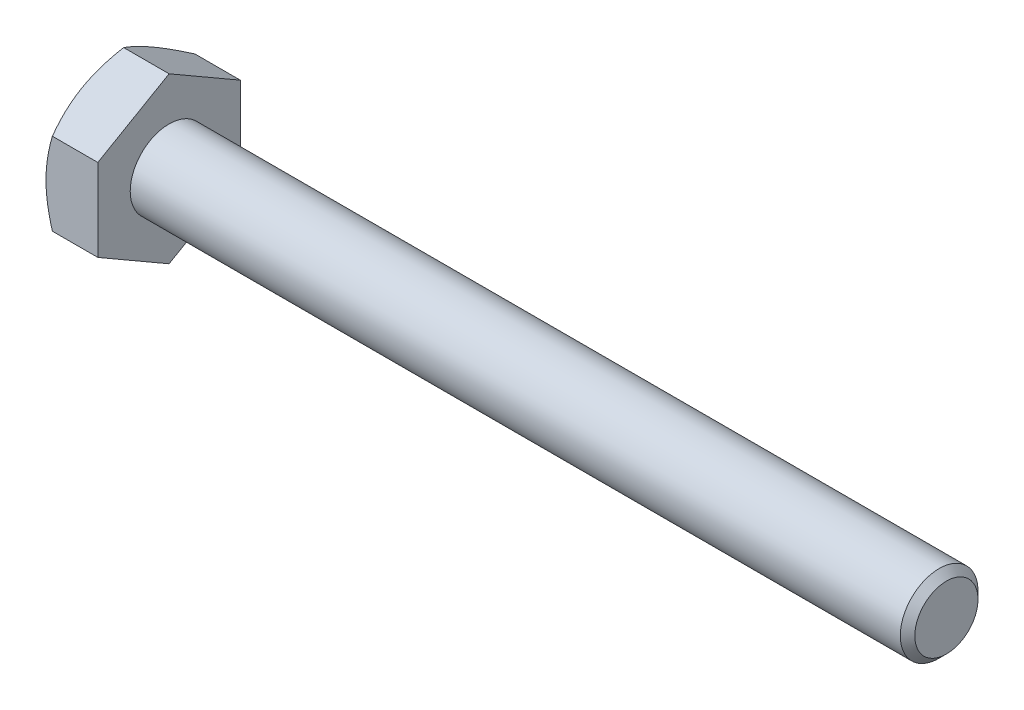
ISO-10303-21;
HEADER;
FILE_DESCRIPTION(('STEP AP214'),'2;1');
FILE_NAME('part.step','',(''),(''),'','','');
FILE_SCHEMA(('AUTOMOTIVE_DESIGN { 1 0 10303 214 1 1 1 1 }'));
ENDSEC;
DATA;
#1=APPLICATION_CONTEXT('core data for automotive mechanical design processes');
#2=APPLICATION_PROTOCOL_DEFINITION('international standard','automotive_design',2000,#1);
#3=PRODUCT_CONTEXT('',#1,'mechanical');
#4=PRODUCT('Part','Part','',(#3));
#5=PRODUCT_RELATED_PRODUCT_CATEGORY('part','',(#4));
#6=PRODUCT_DEFINITION_FORMATION('','',#4);
#7=PRODUCT_DEFINITION_CONTEXT('part definition',#1,'design');
#8=PRODUCT_DEFINITION('design','',#6,#7);
#9=PRODUCT_DEFINITION_SHAPE('','',#8);
#10=(LENGTH_UNIT() NAMED_UNIT(*) SI_UNIT(.MILLI.,.METRE.));
#11=(NAMED_UNIT(*) PLANE_ANGLE_UNIT() SI_UNIT($,.RADIAN.));
#12=(NAMED_UNIT(*) SI_UNIT($,.STERADIAN.) SOLID_ANGLE_UNIT());
#13=UNCERTAINTY_MEASURE_WITH_UNIT(LENGTH_MEASURE(1.E-05),#10,'distance_accuracy_value','');
#14=(GEOMETRIC_REPRESENTATION_CONTEXT(3) GLOBAL_UNCERTAINTY_ASSIGNED_CONTEXT((#13)) GLOBAL_UNIT_ASSIGNED_CONTEXT((#10,
#11,#12)) REPRESENTATION_CONTEXT('',''));
#15=CARTESIAN_POINT('',(0.,0.,0.));
#16=DIRECTION('',(0.,0.,1.));
#17=DIRECTION('',(1.,0.,0.));
#18=AXIS2_PLACEMENT_3D('',#15,#16,#17);
#19=CARTESIAN_POINT('',(2.,1.58771324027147,-2.75));
#20=DIRECTION('',(0.,-0.866025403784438,0.500000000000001));
#21=DIRECTION('',(0.,-0.500000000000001,-0.866025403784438));
#22=AXIS2_PLACEMENT_3D('',#19,#20,#21);
#23=PLANE('',#22);
#24=CARTESIAN_POINT('',(0.245686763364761,3.17554195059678,0.0002));
#25=CARTESIAN_POINT('',(0.205387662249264,3.10576962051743,-0.120649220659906));
#26=CARTESIAN_POINT('',(0.168736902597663,3.03539502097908,-0.242541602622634));
#27=CARTESIAN_POINT('',(0.104762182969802,2.89342717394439,-0.488437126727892));
#28=CARTESIAN_POINT('',(0.0774608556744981,2.82183140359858,-0.612444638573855));
#29=CARTESIAN_POINT('',(0.0349617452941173,2.67952717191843,-0.858922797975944));
#30=CARTESIAN_POINT('',(0.0194811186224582,2.60884060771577,-0.981355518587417));
#31=CARTESIAN_POINT('',(0.000999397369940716,2.46713482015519,-1.22679714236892));
#32=CARTESIAN_POINT('',(-0.00201700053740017,2.39611611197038,-1.34980515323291));
#33=CARTESIAN_POINT('',(0.00425314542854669,2.26341005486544,-1.57965878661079));
#34=CARTESIAN_POINT('',(0.0120001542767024,2.20170285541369,-1.68653879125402));
#35=CARTESIAN_POINT('',(0.0365551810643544,2.07869048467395,-1.89960246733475));
#36=CARTESIAN_POINT('',(0.0533715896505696,2.01738573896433,-2.00578540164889));
#37=CARTESIAN_POINT('',(0.0954119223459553,1.89411967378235,-2.21928848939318));
#38=CARTESIAN_POINT('',(0.12081408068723,1.83217395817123,-2.32658161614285));
#39=CARTESIAN_POINT('',(0.178467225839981,1.70920651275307,-2.53956747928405));
#40=CARTESIAN_POINT('',(0.210704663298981,1.64818320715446,-2.64526294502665));
#41=CARTESIAN_POINT('',(0.245686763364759,1.58759777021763,-2.7502));
#42=B_SPLINE_CURVE_WITH_KNOTS('',3,(#24,#25,#26,#27,#28,#29,#30,#31,#32,#33,#34,#35,#36,#37,#38,
#39,#40,#41),.UNSPECIFIED.,.F.,.F.,(4,2,2,2,2,2,2,2,4),(0.,0.435912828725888,0.872873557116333,
1.29901931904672,1.72464171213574,2.09526089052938,2.46622354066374,2.84541551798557,
3.22386274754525),.UNSPECIFIED.);
#43=CARTESIAN_POINT('',(0.245620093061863,3.17542648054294,0.));
#44=VERTEX_POINT('',#43);
#45=CARTESIAN_POINT('',(0.,2.3815698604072,-1.375));
#46=VERTEX_POINT('',#45);
#47=EDGE_CURVE('E55',#44,#46,#42,.T.);
#48=ORIENTED_EDGE('',*,*,#47,.F.);
#49=DIRECTION('',(-1.,0.,0.));
#50=VECTOR('',#49,1.);
#51=CARTESIAN_POINT('',(2.,3.17542648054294,0.));
#52=LINE('',#51,#50);
#53=CARTESIAN_POINT('',(2.,3.17542648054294,0.));
#54=VERTEX_POINT('',#53);
#55=EDGE_CURVE('E151',#54,#44,#52,.T.);
#56=ORIENTED_EDGE('',*,*,#55,.F.);
#57=DIRECTION('',(0.,0.500000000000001,0.866025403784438));
#58=VECTOR('',#57,1.);
#59=CARTESIAN_POINT('',(2.,1.58771324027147,-2.75));
#60=LINE('',#59,#58);
#61=CARTESIAN_POINT('',(2.,1.58771324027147,-2.75));
#62=VERTEX_POINT('',#61);
#63=EDGE_CURVE('E242',#62,#54,#60,.T.);
#64=ORIENTED_EDGE('',*,*,#63,.F.);
#65=DIRECTION('',(-1.,0.,0.));
#66=VECTOR('',#65,1.);
#67=CARTESIAN_POINT('',(2.,1.58771324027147,-2.75));
#68=LINE('',#67,#66);
#69=CARTESIAN_POINT('',(0.245620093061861,1.58771324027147,-2.75));
#70=VERTEX_POINT('',#69);
#71=EDGE_CURVE('E139',#62,#70,#68,.T.);
#72=ORIENTED_EDGE('',*,*,#71,.T.);
#73=EDGE_CURVE('E133',#46,#70,#42,.T.);
#74=ORIENTED_EDGE('',*,*,#73,.F.);
#75=EDGE_LOOP('',(#48,#56,#64,#72,#74));
#76=FACE_BOUND('',#75,.T.);
#77=ADVANCED_FACE('F39',(#76),#23,.F.);
#78=CARTESIAN_POINT('',(2.,3.17542648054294,0.));
#79=DIRECTION('',(0.,-0.866025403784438,-0.500000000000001));
#80=DIRECTION('',(0.,0.500000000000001,-0.866025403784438));
#81=AXIS2_PLACEMENT_3D('',#78,#79,#80);
#82=PLANE('',#81);
#83=CARTESIAN_POINT('',(0.24568676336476,1.58759777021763,2.7502));
#84=CARTESIAN_POINT('',(0.205387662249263,1.65737010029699,2.62935077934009));
#85=CARTESIAN_POINT('',(0.168736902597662,1.72774469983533,2.50745839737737));
#86=CARTESIAN_POINT('',(0.104762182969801,1.86971254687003,2.26156287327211));
#87=CARTESIAN_POINT('',(0.0774608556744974,1.94130831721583,2.13755536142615));
#88=CARTESIAN_POINT('',(0.0349617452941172,2.08361254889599,1.89107720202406));
#89=CARTESIAN_POINT('',(0.0194811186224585,2.15429911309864,1.76864448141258));
#90=CARTESIAN_POINT('',(0.000999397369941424,2.29600490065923,1.52320285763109));
#91=CARTESIAN_POINT('',(-0.00201700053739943,2.36702360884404,1.40019484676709));
#92=CARTESIAN_POINT('',(0.00425314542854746,2.49972966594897,1.17034121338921));
#93=CARTESIAN_POINT('',(0.0120001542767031,2.56143686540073,1.06346120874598));
#94=CARTESIAN_POINT('',(0.0365551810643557,2.68444923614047,0.850397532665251));
#95=CARTESIAN_POINT('',(0.0533715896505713,2.74575398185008,0.744214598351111));
#96=CARTESIAN_POINT('',(0.0954119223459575,2.86902004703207,0.530711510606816));
#97=CARTESIAN_POINT('',(0.120814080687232,2.93096576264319,0.423418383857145));
#98=CARTESIAN_POINT('',(0.178467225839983,3.05393320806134,0.210432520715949));
#99=CARTESIAN_POINT('',(0.210704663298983,3.11495651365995,0.104737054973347));
#100=CARTESIAN_POINT('',(0.245686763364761,3.17554195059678,-0.000200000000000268));
#101=B_SPLINE_CURVE_WITH_KNOTS('',3,(#83,#84,#85,#86,#87,#88,#89,#90,#91,#92,#93,#94,#95,#96,
#97,#98,#99,#100),.UNSPECIFIED.,.F.,.F.,(4,2,2,2,2,2,2,2,4),(0.,0.435912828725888,
0.872873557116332,1.29901931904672,1.72464171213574,2.09526089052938,2.46622354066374,
2.84541551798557,3.22386274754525),.UNSPECIFIED.);
#102=CARTESIAN_POINT('',(0.245620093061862,1.58771324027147,2.75));
#103=VERTEX_POINT('',#102);
#104=CARTESIAN_POINT('',(0.,2.3815698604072,1.375));
#105=VERTEX_POINT('',#104);
#106=EDGE_CURVE('E62',#103,#105,#101,.T.);
#107=ORIENTED_EDGE('',*,*,#106,.F.);
#108=DIRECTION('',(-1.,0.,0.));
#109=VECTOR('',#108,1.);
#110=CARTESIAN_POINT('',(2.,1.58771324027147,2.75));
#111=LINE('',#110,#109);
#112=CARTESIAN_POINT('',(2.,1.58771324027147,2.75));
#113=VERTEX_POINT('',#112);
#114=EDGE_CURVE('E149',#113,#103,#111,.T.);
#115=ORIENTED_EDGE('',*,*,#114,.F.);
#116=DIRECTION('',(0.,-0.500000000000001,0.866025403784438));
#117=VECTOR('',#116,1.);
#118=CARTESIAN_POINT('',(2.,3.17542648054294,0.));
#119=LINE('',#118,#117);
#120=EDGE_CURVE('E240',#54,#113,#119,.T.);
#121=ORIENTED_EDGE('',*,*,#120,.F.);
#122=ORIENTED_EDGE('',*,*,#55,.T.);
#123=EDGE_CURVE('E166',#105,#44,#101,.T.);
#124=ORIENTED_EDGE('',*,*,#123,.F.);
#125=EDGE_LOOP('',(#107,#115,#121,#122,#124));
#126=FACE_BOUND('',#125,.T.);
#127=ADVANCED_FACE('F172',(#126),#82,.F.);
#128=CARTESIAN_POINT('',(2.,1.58771324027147,2.75));
#129=DIRECTION('',(0.,0.,-1.));
#130=DIRECTION('',(0.,1.,0.));
#131=AXIS2_PLACEMENT_3D('',#128,#129,#130);
#132=PLANE('',#131);
#133=CARTESIAN_POINT('',(1.36715210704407,-4.31638594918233,2.75));
#134=CARTESIAN_POINT('',(1.30845994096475,-4.19581737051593,2.75));
#135=CARTESIAN_POINT('',(1.25031586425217,-4.07497746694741,2.75));
#136=CARTESIAN_POINT('',(1.1354311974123,-3.83261088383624,2.75));
#137=CARTESIAN_POINT('',(1.07869081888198,-3.71108410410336,2.75));
#138=CARTESIAN_POINT('',(0.966646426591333,-3.46659808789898,2.75));
#139=CARTESIAN_POINT('',(0.911351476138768,-3.34363468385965,2.75));
#140=CARTESIAN_POINT('',(0.802956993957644,-3.09674757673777,2.75));
#141=CARTESIAN_POINT('',(0.749857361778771,-2.97282391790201,2.75));
#142=CARTESIAN_POINT('',(0.644703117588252,-2.71965806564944,2.75));
#143=CARTESIAN_POINT('',(0.592742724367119,-2.59037652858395,2.75));
#144=CARTESIAN_POINT('',(0.492631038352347,-2.33032018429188,2.75));
#145=CARTESIAN_POINT('',(0.444480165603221,-2.19954521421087,2.75));
#146=CARTESIAN_POINT('',(0.353213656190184,-1.9365223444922,2.75));
#147=CARTESIAN_POINT('',(0.310088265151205,-1.80427786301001,2.75));
#148=CARTESIAN_POINT('',(0.230222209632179,-1.53789259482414,2.75));
#149=CARTESIAN_POINT('',(0.193479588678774,-1.40375240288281,2.75));
#150=CARTESIAN_POINT('',(0.12830206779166,-1.13423793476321,2.75));
#151=CARTESIAN_POINT('',(0.0998212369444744,-0.998874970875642,2.75));
#152=CARTESIAN_POINT('',(0.0527456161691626,-0.726413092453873,2.75));
#153=CARTESIAN_POINT('',(0.0341497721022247,-0.589314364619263,2.75));
#154=CARTESIAN_POINT('',(0.0085685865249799,-0.315877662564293,2.75));
#155=CARTESIAN_POINT('',(0.00142992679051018,-0.17955439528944,2.75));
#156=CARTESIAN_POINT('',(-0.00103867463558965,0.093213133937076,2.75));
#157=CARTESIAN_POINT('',(0.00363158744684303,0.229657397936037,2.75));
#158=CARTESIAN_POINT('',(0.021130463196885,0.459764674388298,2.75));
#159=CARTESIAN_POINT('',(0.0310050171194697,0.553667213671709,2.75));
#160=CARTESIAN_POINT('',(0.0557601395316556,0.740814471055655,2.75));
#161=CARTESIAN_POINT('',(0.0706413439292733,0.834059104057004,2.75));
#162=CARTESIAN_POINT('',(0.122015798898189,1.1126628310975,2.75));
#163=CARTESIAN_POINT('',(0.165231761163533,1.29679769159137,2.75));
#164=CARTESIAN_POINT('',(0.240559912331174,1.57226006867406,2.75));
#165=CARTESIAN_POINT('',(0.267790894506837,1.66500394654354,2.75));
#166=CARTESIAN_POINT('',(0.325176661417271,1.84959145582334,2.75));
#167=CARTESIAN_POINT('',(0.355331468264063,1.94143508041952,2.75));
#168=CARTESIAN_POINT('',(0.418073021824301,2.12425036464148,2.75));
#169=CARTESIAN_POINT('',(0.450659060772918,2.21522226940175,2.75));
#170=CARTESIAN_POINT('',(0.517870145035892,2.39640501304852,2.75));
#171=CARTESIAN_POINT('',(0.552495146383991,2.48661586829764,2.75));
#172=CARTESIAN_POINT('',(0.647111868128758,2.72631941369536,2.75));
#173=CARTESIAN_POINT('',(0.708617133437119,2.87521406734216,2.75));
#174=CARTESIAN_POINT('',(0.83516310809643,3.17149877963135,2.75));
#175=CARTESIAN_POINT('',(0.900204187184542,3.31888867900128,2.75));
#176=CARTESIAN_POINT('',(1.03299372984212,3.61249860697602,2.75));
#177=CARTESIAN_POINT('',(1.1007430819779,3.75871823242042,2.75));
#178=CARTESIAN_POINT('',(1.23832197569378,4.05017738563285,2.75));
#179=CARTESIAN_POINT('',(1.30815157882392,4.19541688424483,2.75));
#180=CARTESIAN_POINT('',(1.5202722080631,4.63039070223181,2.75));
#181=CARTESIAN_POINT('',(1.66499194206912,4.91893915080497,2.75));
#182=CARTESIAN_POINT('',(1.95851426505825,5.49386340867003,2.75));
#183=CARTESIAN_POINT('',(2.10731603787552,5.78023963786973,2.75));
#184=CARTESIAN_POINT('',(2.39216757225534,6.32194576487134,2.75));
#185=CARTESIAN_POINT('',(2.52794261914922,6.57742037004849,2.75));
#186=CARTESIAN_POINT('',(2.80114245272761,7.08750371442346,2.75));
#187=CARTESIAN_POINT('',(2.93856733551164,7.34211240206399,2.75));
#188=CARTESIAN_POINT('',(3.21419429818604,7.84983547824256,2.75));
#189=CARTESIAN_POINT('',(3.35239239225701,8.10295203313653,2.75));
#190=CARTESIAN_POINT('',(3.62973059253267,8.60864374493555,2.75));
#191=CARTESIAN_POINT('',(3.76887062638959,8.86121894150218,2.75));
#192=CARTESIAN_POINT('',(3.90835389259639,9.11360311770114,2.75));
#193=B_SPLINE_CURVE_WITH_KNOTS('',3,(#133,#134,#135,#136,#137,#138,#139,#140,#141,#142,#143,
#144,#145,#146,#147,#148,#149,#150,#151,#152,#153,#154,#155,#156,#157,#158,#159,#160,#161,#162,
#163,#164,#165,#166,#167,#168,#169,#170,#171,#172,#173,#174,#175,#176,#177,#178,#179,#180,#181,
#182,#183,#184,#185,#186,#187,#188,#189,#190,#191,#192),.UNSPECIFIED.,.F.,.F.,(4,2,2,2,2,2,2,2,
2,2,2,2,2,2,2,2,2,2,2,2,2,2,2,2,2,2,2,2,2,4),(0.,0.40229060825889,0.804641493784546,
1.20909649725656,1.61353297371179,2.03148461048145,2.44948226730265,2.86665458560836,
3.28369880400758,3.69837799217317,4.11301294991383,4.52205162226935,4.9310973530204,
5.21422195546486,5.49738253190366,6.06398562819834,6.35393648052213,6.6438895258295,
6.933758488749,7.2236212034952,7.70684704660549,8.19012351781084,8.67355987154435,
9.15701054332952,10.1253686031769,11.0935344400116,11.9614658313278,12.8294480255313,
13.6946049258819,14.5596961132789),.UNSPECIFIED.);
#194=CARTESIAN_POINT('',(0.245620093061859,-1.58771324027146,2.75));
#195=VERTEX_POINT('',#194);
#196=CARTESIAN_POINT('',(0.,0.,2.75));
#197=VERTEX_POINT('',#196);
#198=EDGE_CURVE('E252',#195,#197,#193,.T.);
#199=ORIENTED_EDGE('',*,*,#198,.F.);
#200=DIRECTION('',(-1.,0.,0.));
#201=VECTOR('',#200,1.);
#202=CARTESIAN_POINT('',(2.,-1.58771324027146,2.75));
#203=LINE('',#202,#201);
#204=CARTESIAN_POINT('',(2.,-1.58771324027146,2.75));
#205=VERTEX_POINT('',#204);
#206=EDGE_CURVE('E141',#205,#195,#203,.T.);
#207=ORIENTED_EDGE('',*,*,#206,.F.);
#208=DIRECTION('',(0.,-1.,0.));
#209=VECTOR('',#208,1.);
#210=CARTESIAN_POINT('',(2.,1.58771324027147,2.75));
#211=LINE('',#210,#209);
#212=EDGE_CURVE('E236',#113,#205,#211,.T.);
#213=ORIENTED_EDGE('',*,*,#212,.F.);
#214=ORIENTED_EDGE('',*,*,#114,.T.);
#215=EDGE_CURVE('E190',#197,#103,#193,.T.);
#216=ORIENTED_EDGE('',*,*,#215,.F.);
#217=EDGE_LOOP('',(#199,#207,#213,#214,#216));
#218=FACE_BOUND('',#217,.T.);
#219=ADVANCED_FACE('F258',(#218),#132,.F.);
#220=CARTESIAN_POINT('',(2.,-3.17542648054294,0.));
#221=DIRECTION('',(0.,0.866025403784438,-0.500000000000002));
#222=DIRECTION('',(0.,0.500000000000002,0.866025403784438));
#223=AXIS2_PLACEMENT_3D('',#220,#221,#222);
#224=PLANE('',#223);
#225=CARTESIAN_POINT('',(0.245686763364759,-3.17554195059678,-0.000200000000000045));
#226=CARTESIAN_POINT('',(0.205387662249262,-3.10576962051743,0.120649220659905));
#227=CARTESIAN_POINT('',(0.168736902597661,-3.03539502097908,0.242541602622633));
#228=CARTESIAN_POINT('',(0.104762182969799,-2.89342717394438,0.488437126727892));
#229=CARTESIAN_POINT('',(0.0774608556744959,-2.82183140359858,0.612444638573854));
#230=CARTESIAN_POINT('',(0.0349617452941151,-2.67952717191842,0.858922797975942));
#231=CARTESIAN_POINT('',(0.019481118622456,-2.60884060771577,0.981355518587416));
#232=CARTESIAN_POINT('',(0.000999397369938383,-2.46713482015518,1.22679714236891));
#233=CARTESIAN_POINT('',(-0.00201700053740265,-2.39611611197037,1.34980515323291));
#234=CARTESIAN_POINT('',(0.00425314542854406,-2.26341005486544,1.57965878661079));
#235=CARTESIAN_POINT('',(0.0120001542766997,-2.20170285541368,1.68653879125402));
#236=CARTESIAN_POINT('',(0.0365551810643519,-2.07869048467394,1.89960246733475));
#237=CARTESIAN_POINT('',(0.0533715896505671,-2.01738573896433,2.00578540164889));
#238=CARTESIAN_POINT('',(0.095411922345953,-1.89411967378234,2.21928848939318));
#239=CARTESIAN_POINT('',(0.120814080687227,-1.83217395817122,2.32658161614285));
#240=CARTESIAN_POINT('',(0.178467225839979,-1.70920651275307,2.53956747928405));
#241=CARTESIAN_POINT('',(0.210704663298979,-1.64818320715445,2.64526294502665));
#242=CARTESIAN_POINT('',(0.245686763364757,-1.58759777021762,2.7502));
#243=B_SPLINE_CURVE_WITH_KNOTS('',3,(#225,#226,#227,#228,#229,#230,#231,#232,#233,#234,#235,
#236,#237,#238,#239,#240,#241,#242),.UNSPECIFIED.,.F.,.F.,(4,2,2,2,2,2,2,2,4),(0.,
0.435912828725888,0.872873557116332,1.29901931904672,1.72464171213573,2.09526089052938,
2.46622354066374,2.84541551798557,3.22386274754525),.UNSPECIFIED.);
#244=CARTESIAN_POINT('',(0.245620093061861,-3.17542648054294,0.));
#245=VERTEX_POINT('',#244);
#246=CARTESIAN_POINT('',(0.,-2.3815698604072,1.375));
#247=VERTEX_POINT('',#246);
#248=EDGE_CURVE('E174',#245,#247,#243,.T.);
#249=ORIENTED_EDGE('',*,*,#248,.F.);
#250=DIRECTION('',(-1.,0.,0.));
#251=VECTOR('',#250,1.);
#252=CARTESIAN_POINT('',(2.,-3.17542648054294,0.));
#253=LINE('',#252,#251);
#254=CARTESIAN_POINT('',(2.,-3.17542648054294,0.));
#255=VERTEX_POINT('',#254);
#256=EDGE_CURVE('E138',#255,#245,#253,.T.);
#257=ORIENTED_EDGE('',*,*,#256,.F.);
#258=DIRECTION('',(0.,-0.500000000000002,-0.866025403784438));
#259=VECTOR('',#258,1.);
#260=CARTESIAN_POINT('',(2.,-3.17542648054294,0.));
#261=LINE('',#260,#259);
#262=EDGE_CURVE('E234',#205,#255,#261,.T.);
#263=ORIENTED_EDGE('',*,*,#262,.F.);
#264=ORIENTED_EDGE('',*,*,#206,.T.);
#265=EDGE_CURVE('E176',#247,#195,#243,.T.);
#266=ORIENTED_EDGE('',*,*,#265,.F.);
#267=EDGE_LOOP('',(#249,#257,#263,#264,#266));
#268=FACE_BOUND('',#267,.T.);
#269=ADVANCED_FACE('F230',(#268),#224,.F.);
#270=CARTESIAN_POINT('',(2.,-1.58771324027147,-2.75));
#271=DIRECTION('',(0.,0.866025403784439,0.499999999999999));
#272=DIRECTION('',(0.,-0.499999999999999,0.866025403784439));
#273=AXIS2_PLACEMENT_3D('',#270,#271,#272);
#274=PLANE('',#273);
#275=CARTESIAN_POINT('',(0.24568676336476,-1.58759777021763,-2.7502));
#276=CARTESIAN_POINT('',(0.205387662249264,-1.65737010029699,-2.6293507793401));
#277=CARTESIAN_POINT('',(0.168736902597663,-1.72774469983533,-2.50745839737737));
#278=CARTESIAN_POINT('',(0.104762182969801,-1.86971254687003,-2.26156287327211));
#279=CARTESIAN_POINT('',(0.0774608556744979,-1.94130831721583,-2.13755536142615));
#280=CARTESIAN_POINT('',(0.0349617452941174,-2.08361254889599,-1.89107720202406));
#281=CARTESIAN_POINT('',(0.0194811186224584,-2.15429911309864,-1.76864448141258));
#282=CARTESIAN_POINT('',(0.000999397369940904,-2.29600490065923,-1.52320285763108));
#283=CARTESIAN_POINT('',(-0.00201700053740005,-2.36702360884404,-1.40019484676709));
#284=CARTESIAN_POINT('',(0.00425314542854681,-2.49972966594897,-1.17034121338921));
#285=CARTESIAN_POINT('',(0.0120001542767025,-2.56143686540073,-1.06346120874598));
#286=CARTESIAN_POINT('',(0.0365551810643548,-2.68444923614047,-0.85039753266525));
#287=CARTESIAN_POINT('',(0.0533715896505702,-2.74575398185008,-0.744214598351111));
#288=CARTESIAN_POINT('',(0.0954119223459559,-2.86902004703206,-0.530711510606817));
#289=CARTESIAN_POINT('',(0.12081408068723,-2.93096576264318,-0.423418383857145));
#290=CARTESIAN_POINT('',(0.178467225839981,-3.05393320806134,-0.210432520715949));
#291=CARTESIAN_POINT('',(0.210704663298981,-3.11495651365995,-0.104737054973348));
#292=CARTESIAN_POINT('',(0.245686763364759,-3.17554195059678,0.000199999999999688));
#293=B_SPLINE_CURVE_WITH_KNOTS('',3,(#275,#276,#277,#278,#279,#280,#281,#282,#283,#284,#285,
#286,#287,#288,#289,#290,#291,#292),.UNSPECIFIED.,.F.,.F.,(4,2,2,2,2,2,2,2,4),(0.,
0.435912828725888,0.872873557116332,1.29901931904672,1.72464171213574,2.09526089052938,
2.46622354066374,2.84541551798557,3.22386274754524),.UNSPECIFIED.);
#294=CARTESIAN_POINT('',(0.245620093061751,-1.58771324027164,-2.75));
#295=VERTEX_POINT('',#294);
#296=CARTESIAN_POINT('',(0.,-2.38156986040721,-1.375));
#297=VERTEX_POINT('',#296);
#298=EDGE_CURVE('E115',#295,#297,#293,.T.);
#299=ORIENTED_EDGE('',*,*,#298,.F.);
#300=DIRECTION('',(-1.,0.,0.));
#301=VECTOR('',#300,1.);
#302=CARTESIAN_POINT('',(2.,-1.58771324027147,-2.75));
#303=LINE('',#302,#301);
#304=CARTESIAN_POINT('',(2.,-1.58771324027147,-2.75));
#305=VERTEX_POINT('',#304);
#306=EDGE_CURVE('E129',#305,#295,#303,.T.);
#307=ORIENTED_EDGE('',*,*,#306,.F.);
#308=DIRECTION('',(0.,0.499999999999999,-0.866025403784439));
#309=VECTOR('',#308,1.);
#310=CARTESIAN_POINT('',(2.,-1.58771324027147,-2.75));
#311=LINE('',#310,#309);
#312=EDGE_CURVE('E232',#255,#305,#311,.T.);
#313=ORIENTED_EDGE('',*,*,#312,.F.);
#314=ORIENTED_EDGE('',*,*,#256,.T.);
#315=EDGE_CURVE('E132',#297,#245,#293,.T.);
#316=ORIENTED_EDGE('',*,*,#315,.F.);
#317=EDGE_LOOP('',(#299,#307,#313,#314,#316));
#318=FACE_BOUND('',#317,.T.);
#319=ADVANCED_FACE('F127',(#318),#274,.F.);
#320=CARTESIAN_POINT('',(2.,1.58771324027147,-2.75));
#321=DIRECTION('',(0.,0.,1.));
#322=DIRECTION('',(0.,-1.,0.));
#323=AXIS2_PLACEMENT_3D('',#320,#321,#322);
#324=PLANE('',#323);
#325=CARTESIAN_POINT('',(1.3671521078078,-4.31638595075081,-2.75));
#326=CARTESIAN_POINT('',(1.30845994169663,-4.19581737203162,-2.75));
#327=CARTESIAN_POINT('',(1.25031586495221,-4.07497746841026,-2.75));
#328=CARTESIAN_POINT('',(1.13543119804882,-3.83261088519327,-2.75));
#329=CARTESIAN_POINT('',(1.07869081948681,-3.7110841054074,-2.75));
#330=CARTESIAN_POINT('',(0.966646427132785,-3.46659808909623,-2.75));
#331=CARTESIAN_POINT('',(0.911351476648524,-3.3436346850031,-2.75));
#332=CARTESIAN_POINT('',(0.802956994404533,-3.09674757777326,-2.75));
#333=CARTESIAN_POINT('',(0.749857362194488,-2.97282391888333,-2.75));
#334=CARTESIAN_POINT('',(0.644703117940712,-2.71965806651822,-2.75));
#335=CARTESIAN_POINT('',(0.592742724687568,-2.59037652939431,-2.75));
#336=CARTESIAN_POINT('',(0.492631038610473,-2.33032018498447,-2.75));
#337=CARTESIAN_POINT('',(0.444480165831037,-2.19954521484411,-2.75));
#338=CARTESIAN_POINT('',(0.353213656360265,-1.93652234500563,-2.75));
#339=CARTESIAN_POINT('',(0.310088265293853,-1.80427786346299,-2.75));
#340=CARTESIAN_POINT('',(0.230222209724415,-1.53789259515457,-2.75));
#341=CARTESIAN_POINT('',(0.193479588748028,-1.40375240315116,-2.75));
#342=CARTESIAN_POINT('',(0.128302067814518,-1.13423793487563,-2.75));
#343=CARTESIAN_POINT('',(0.0998212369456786,-0.9988749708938,-2.75));
#344=CARTESIAN_POINT('',(0.0527456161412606,-0.726413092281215,-2.75));
#345=CARTESIAN_POINT('',(0.0341497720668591,-0.589314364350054,-2.75));
#346=CARTESIAN_POINT('',(0.0085685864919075,-0.31587766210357,-2.75));
#347=CARTESIAN_POINT('',(0.00142992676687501,-0.179554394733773,-2.75));
#348=CARTESIAN_POINT('',(-0.00103867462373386,0.0932131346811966,-2.75));
#349=CARTESIAN_POINT('',(0.00363158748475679,0.229657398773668,-2.75));
#350=CARTESIAN_POINT('',(0.0211304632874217,0.459764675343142,-2.75));
#351=CARTESIAN_POINT('',(0.0310050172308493,0.553667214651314,-2.75));
#352=CARTESIAN_POINT('',(0.0557601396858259,0.740814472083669,-2.75));
#353=CARTESIAN_POINT('',(0.0706413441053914,0.834059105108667,-2.75));
#354=CARTESIAN_POINT('',(0.122015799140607,1.1126628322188,-2.75));
#355=CARTESIAN_POINT('',(0.165231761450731,1.29679769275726,-2.75));
#356=CARTESIAN_POINT('',(0.240559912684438,1.57226006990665,-2.75));
#357=CARTESIAN_POINT('',(0.267790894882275,1.66500394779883,-2.75));
#358=CARTESIAN_POINT('',(0.325176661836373,1.8495914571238,-2.75));
#359=CARTESIAN_POINT('',(0.355331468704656,1.94143508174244,-2.75));
#360=CARTESIAN_POINT('',(0.418073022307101,2.12425036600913,-2.75));
#361=CARTESIAN_POINT('',(0.450659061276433,2.21522227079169,-2.75));
#362=CARTESIAN_POINT('',(0.517870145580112,2.39640501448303,-2.75));
#363=CARTESIAN_POINT('',(0.5524951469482,2.48661586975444,-2.75));
#364=CARTESIAN_POINT('',(0.647111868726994,2.72631941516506,-2.75));
#365=CARTESIAN_POINT('',(0.708617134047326,2.87521406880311,-2.75));
#366=CARTESIAN_POINT('',(0.835163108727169,3.17149878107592,-2.75));
#367=CARTESIAN_POINT('',(0.900204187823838,3.31888868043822,-2.75));
#368=CARTESIAN_POINT('',(1.03299373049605,3.61249860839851,-2.75));
#369=CARTESIAN_POINT('',(1.10074308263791,3.7587182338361,-2.75));
#370=CARTESIAN_POINT('',(1.23832197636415,4.05017738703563,-2.75));
#371=CARTESIAN_POINT('',(1.30815157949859,4.19541688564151,-2.75));
#372=CARTESIAN_POINT('',(1.52027220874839,4.63039070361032,-2.75));
#373=CARTESIAN_POINT('',(1.6649919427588,4.91893915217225,-2.75));
#374=CARTESIAN_POINT('',(1.95851426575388,5.49386341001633,-2.75));
#375=CARTESIAN_POINT('',(2.10731603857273,5.78023963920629,-2.75));
#376=CARTESIAN_POINT('',(2.39216757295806,6.32194576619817,-2.75));
#377=CARTESIAN_POINT('',(2.52794261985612,6.57742037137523,-2.75));
#378=CARTESIAN_POINT('',(2.80114245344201,7.08750371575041,-2.75));
#379=CARTESIAN_POINT('',(2.93856733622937,7.34211240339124,-2.75));
#380=CARTESIAN_POINT('',(3.21419429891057,7.84983547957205,-2.75));
#381=CARTESIAN_POINT('',(3.35239239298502,8.10295203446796,-2.75));
#382=CARTESIAN_POINT('',(3.62973059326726,8.6086437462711,-2.75));
#383=CARTESIAN_POINT('',(3.76887062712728,8.86121894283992,-2.75));
#384=CARTESIAN_POINT('',(3.90835389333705,9.11360311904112,-2.75));
#385=B_SPLINE_CURVE_WITH_KNOTS('',3,(#325,#326,#327,#328,#329,#330,#331,#332,#333,#334,#335,
#336,#337,#338,#339,#340,#341,#342,#343,#344,#345,#346,#347,#348,#349,#350,#351,#352,#353,#354,
#355,#356,#357,#358,#359,#360,#361,#362,#363,#364,#365,#366,#367,#368,#369,#370,#371,#372,#373,
#374,#375,#376,#377,#378,#379,#380,#381,#382,#383,#384),.UNSPECIFIED.,.F.,.F.,(4,2,2,2,2,2,2,2,
2,2,2,2,2,2,2,2,2,2,2,2,2,2,2,2,2,2,2,2,2,4),(0.,0.402290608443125,0.804641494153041,
1.20909649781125,1.61353297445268,2.03148461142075,2.44948226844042,2.86665458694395,
3.28369880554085,3.69837799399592,4.11301295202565,4.52205162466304,4.93109735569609,
5.21422195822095,5.49738253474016,6.06398563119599,6.35393648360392,6.64388952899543,
6.93375849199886,7.22362120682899,7.70684704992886,8.19012352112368,8.67355987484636,
9.15701054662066,10.1253686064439,11.0935344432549,11.9614658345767,12.8294480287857,
13.6946049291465,14.5596961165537),.UNSPECIFIED.);
#386=CARTESIAN_POINT('',(0.,0.,-2.75));
#387=VERTEX_POINT('',#386);
#388=EDGE_CURVE('E121',#70,#387,#385,.F.);
#389=ORIENTED_EDGE('',*,*,#388,.F.);
#390=ORIENTED_EDGE('',*,*,#71,.F.);
#391=DIRECTION('',(0.,1.,0.));
#392=VECTOR('',#391,1.);
#393=CARTESIAN_POINT('',(2.,1.58771324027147,-2.75));
#394=LINE('',#393,#392);
#395=EDGE_CURVE('E137',#305,#62,#394,.T.);
#396=ORIENTED_EDGE('',*,*,#395,.F.);
#397=ORIENTED_EDGE('',*,*,#306,.T.);
#398=EDGE_CURVE('E112',#387,#295,#385,.F.);
#399=ORIENTED_EDGE('',*,*,#398,.F.);
#400=EDGE_LOOP('',(#389,#390,#396,#397,#399));
#401=FACE_BOUND('',#400,.T.);
#402=ADVANCED_FACE('F135',(#401),#324,.F.);
#403=CARTESIAN_POINT('',(2.,3.17542648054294,0.));
#404=DIRECTION('',(1.,0.,0.));
#405=DIRECTION('',(0.,0.,-1.));
#406=AXIS2_PLACEMENT_3D('',#403,#404,#405);
#407=PLANE('',#406);
#408=CARTESIAN_POINT('',(2.,0.,0.));
#409=DIRECTION('',(1.,0.,0.));
#410=DIRECTION('',(0.,0.,-1.));
#411=AXIS2_PLACEMENT_3D('',#408,#409,#410);
#412=CIRCLE('',#411,1.5);
#413=CARTESIAN_POINT('',(2.,0.,-1.5));
#414=VERTEX_POINT('',#413);
#415=EDGE_CURVE('E245',#414,#414,#412,.F.);
#416=ORIENTED_EDGE('',*,*,#415,.T.);
#417=EDGE_LOOP('',(#416));
#418=FACE_BOUND('',#417,.T.);
#419=ORIENTED_EDGE('',*,*,#63,.T.);
#420=ORIENTED_EDGE('',*,*,#120,.T.);
#421=ORIENTED_EDGE('',*,*,#212,.T.);
#422=ORIENTED_EDGE('',*,*,#262,.T.);
#423=ORIENTED_EDGE('',*,*,#312,.T.);
#424=ORIENTED_EDGE('',*,*,#395,.T.);
#425=EDGE_LOOP('',(#419,#420,#421,#422,#423,#424));
#426=FACE_BOUND('',#425,.T.);
#427=ADVANCED_FACE('F260',(#418,#426),#407,.T.);
#428=CARTESIAN_POINT('',(0.,0.,0.));
#429=DIRECTION('',(-1.,0.,0.));
#430=DIRECTION('',(0.,0.,1.));
#431=AXIS2_PLACEMENT_3D('',#428,#429,#430);
#432=CYLINDRICAL_SURFACE('',#431,1.5);
#433=ORIENTED_EDGE('',*,*,#415,.F.);
#434=EDGE_LOOP('',(#433));
#435=FACE_BOUND('',#434,.T.);
#436=CARTESIAN_POINT('',(31.7195,0.,0.));
#437=DIRECTION('',(-1.,0.,0.));
#438=DIRECTION('',(0.,0.,1.));
#439=AXIS2_PLACEMENT_3D('',#436,#437,#438);
#440=CIRCLE('',#439,1.5);
#441=CARTESIAN_POINT('',(31.7195,0.,1.5));
#442=VERTEX_POINT('',#441);
#443=EDGE_CURVE('E248',#442,#442,#440,.T.);
#444=ORIENTED_EDGE('',*,*,#443,.T.);
#445=EDGE_LOOP('',(#444));
#446=FACE_BOUND('',#445,.T.);
#447=ADVANCED_FACE('F291',(#435,#446),#432,.T.);
#448=CARTESIAN_POINT('',(32.,0.,0.));
#449=DIRECTION('',(-1.,0.,0.));
#450=DIRECTION('',(0.,0.,1.));
#451=AXIS2_PLACEMENT_3D('',#448,#449,#450);
#452=CONICAL_SURFACE('',#451,1.2195,0.785398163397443);
#453=ORIENTED_EDGE('',*,*,#443,.F.);
#454=EDGE_LOOP('',(#453));
#455=FACE_BOUND('',#454,.T.);
#456=CARTESIAN_POINT('',(32.,0.,0.));
#457=DIRECTION('',(-1.,0.,0.));
#458=DIRECTION('',(0.,0.,1.));
#459=AXIS2_PLACEMENT_3D('',#456,#457,#458);
#460=CIRCLE('',#459,1.2195);
#461=CARTESIAN_POINT('',(32.,0.,1.2195));
#462=VERTEX_POINT('',#461);
#463=EDGE_CURVE('E250',#462,#462,#460,.T.);
#464=ORIENTED_EDGE('',*,*,#463,.T.);
#465=EDGE_LOOP('',(#464));
#466=FACE_BOUND('',#465,.T.);
#467=ADVANCED_FACE('F294',(#455,#466),#452,.T.);
#468=CARTESIAN_POINT('',(32.,0.,0.));
#469=DIRECTION('',(-1.,0.,0.));
#470=DIRECTION('',(0.,0.,1.));
#471=AXIS2_PLACEMENT_3D('',#468,#469,#470);
#472=PLANE('',#471);
#473=ORIENTED_EDGE('',*,*,#463,.F.);
#474=EDGE_LOOP('',(#473));
#475=FACE_BOUND('',#474,.T.);
#476=ADVANCED_FACE('F204',(#475),#472,.F.);
#477=CARTESIAN_POINT('',(0.,0.,0.));
#478=DIRECTION('',(1.,0.,0.));
#479=DIRECTION('',(0.,0.,-1.));
#480=AXIS2_PLACEMENT_3D('',#477,#478,#479);
#481=CONICAL_SURFACE('',#480,2.75,1.0471975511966);
#482=ORIENTED_EDGE('',*,*,#298,.T.);
#483=CARTESIAN_POINT('',(0.,0.,0.));
#484=DIRECTION('',(1.,0.,0.));
#485=DIRECTION('',(0.,0.,-1.));
#486=AXIS2_PLACEMENT_3D('',#483,#484,#485);
#487=CIRCLE('',#486,2.75);
#488=EDGE_CURVE('E43',#297,#387,#487,.T.);
#489=ORIENTED_EDGE('',*,*,#488,.T.);
#490=ORIENTED_EDGE('',*,*,#398,.T.);
#491=EDGE_LOOP('',(#482,#489,#490));
#492=FACE_BOUND('',#491,.T.);
#493=ADVANCED_FACE('F114',(#492),#481,.T.);
#494=ORIENTED_EDGE('',*,*,#248,.T.);
#495=EDGE_CURVE('E156',#247,#297,#487,.T.);
#496=ORIENTED_EDGE('',*,*,#495,.T.);
#497=ORIENTED_EDGE('',*,*,#315,.T.);
#498=EDGE_LOOP('',(#494,#496,#497));
#499=FACE_BOUND('',#498,.T.);
#500=ADVANCED_FACE('F203',(#499),#481,.T.);
#501=ORIENTED_EDGE('',*,*,#198,.T.);
#502=EDGE_CURVE('E157',#197,#247,#487,.T.);
#503=ORIENTED_EDGE('',*,*,#502,.T.);
#504=ORIENTED_EDGE('',*,*,#265,.T.);
#505=EDGE_LOOP('',(#501,#503,#504));
#506=FACE_BOUND('',#505,.T.);
#507=ADVANCED_FACE('F198',(#506),#481,.T.);
#508=ORIENTED_EDGE('',*,*,#215,.T.);
#509=ORIENTED_EDGE('',*,*,#106,.T.);
#510=CARTESIAN_POINT('',(0.,0.,0.));
#511=DIRECTION('',(-1.,0.,0.));
#512=DIRECTION('',(0.,0.,1.));
#513=AXIS2_PLACEMENT_3D('',#510,#511,#512);
#514=CIRCLE('',#513,2.75);
#515=EDGE_CURVE('E122',#197,#105,#514,.T.);
#516=ORIENTED_EDGE('',*,*,#515,.F.);
#517=EDGE_LOOP('',(#508,#509,#516));
#518=FACE_BOUND('',#517,.T.);
#519=ADVANCED_FACE('F202',(#518),#481,.T.);
#520=ORIENTED_EDGE('',*,*,#123,.T.);
#521=ORIENTED_EDGE('',*,*,#47,.T.);
#522=EDGE_CURVE('E48',#46,#105,#487,.T.);
#523=ORIENTED_EDGE('',*,*,#522,.T.);
#524=EDGE_LOOP('',(#520,#521,#523));
#525=FACE_BOUND('',#524,.T.);
#526=ADVANCED_FACE('F165',(#525),#481,.T.);
#527=ORIENTED_EDGE('',*,*,#73,.T.);
#528=ORIENTED_EDGE('',*,*,#388,.T.);
#529=EDGE_CURVE('E11',#387,#46,#487,.T.);
#530=ORIENTED_EDGE('',*,*,#529,.T.);
#531=EDGE_LOOP('',(#527,#528,#530));
#532=FACE_BOUND('',#531,.T.);
#533=ADVANCED_FACE('F263',(#532),#481,.T.);
#534=CARTESIAN_POINT('',(0.,3.17542648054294,0.));
#535=DIRECTION('',(1.,0.,0.));
#536=DIRECTION('',(0.,0.,-1.));
#537=AXIS2_PLACEMENT_3D('',#534,#535,#536);
#538=PLANE('',#537);
#539=ORIENTED_EDGE('',*,*,#529,.F.);
#540=ORIENTED_EDGE('',*,*,#488,.F.);
#541=ORIENTED_EDGE('',*,*,#495,.F.);
#542=ORIENTED_EDGE('',*,*,#502,.F.);
#543=ORIENTED_EDGE('',*,*,#515,.T.);
#544=ORIENTED_EDGE('',*,*,#522,.F.);
#545=EDGE_LOOP('',(#539,#540,#541,#542,#543,#544));
#546=FACE_BOUND('',#545,.T.);
#547=ADVANCED_FACE('F169',(#546),#538,.F.);
#548=CLOSED_SHELL('',(#77,#127,#219,#269,#319,#402,#427,#447,#467,#476,#493,#500,#507,#519,#526,
#533,#547));
#549=MANIFOLD_SOLID_BREP('B2',#548);
#550=ADVANCED_BREP_SHAPE_REPRESENTATION('',(#18,#549),#14);
#551=SHAPE_DEFINITION_REPRESENTATION(#9,#550);
ENDSEC;
END-ISO-10303-21;
